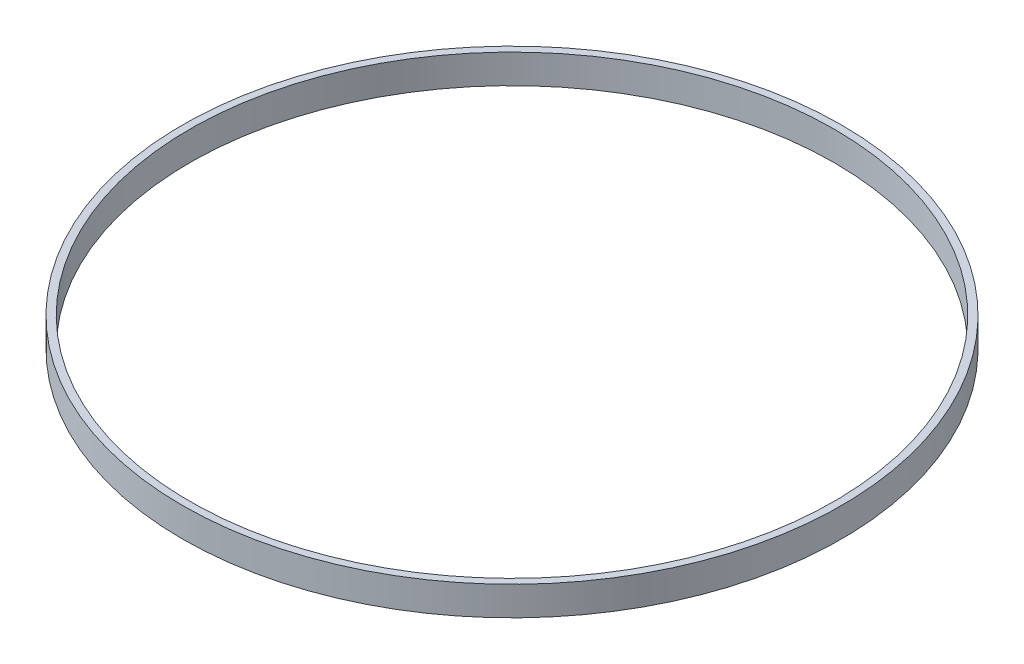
ISO-10303-21;
HEADER;
FILE_DESCRIPTION(('STEP AP214'),'2;1');
FILE_NAME('part.step','',(''),(''),'','','');
FILE_SCHEMA(('AUTOMOTIVE_DESIGN { 1 0 10303 214 1 1 1 1 }'));
ENDSEC;
DATA;
#1=APPLICATION_CONTEXT('core data for automotive mechanical design processes');
#2=APPLICATION_PROTOCOL_DEFINITION('international standard','automotive_design',2000,#1);
#3=PRODUCT_CONTEXT('',#1,'mechanical');
#4=PRODUCT('Part','Part','',(#3));
#5=PRODUCT_RELATED_PRODUCT_CATEGORY('part','',(#4));
#6=PRODUCT_DEFINITION_FORMATION('','',#4);
#7=PRODUCT_DEFINITION_CONTEXT('part definition',#1,'design');
#8=PRODUCT_DEFINITION('design','',#6,#7);
#9=PRODUCT_DEFINITION_SHAPE('','',#8);
#10=(LENGTH_UNIT() NAMED_UNIT(*) SI_UNIT(.MILLI.,.METRE.));
#11=(NAMED_UNIT(*) PLANE_ANGLE_UNIT() SI_UNIT($,.RADIAN.));
#12=(NAMED_UNIT(*) SI_UNIT($,.STERADIAN.) SOLID_ANGLE_UNIT());
#13=UNCERTAINTY_MEASURE_WITH_UNIT(LENGTH_MEASURE(1.E-05),#10,'distance_accuracy_value','');
#14=(GEOMETRIC_REPRESENTATION_CONTEXT(3) GLOBAL_UNCERTAINTY_ASSIGNED_CONTEXT((#13)) GLOBAL_UNIT_ASSIGNED_CONTEXT((#10,
#11,#12)) REPRESENTATION_CONTEXT('',''));
#15=CARTESIAN_POINT('',(0.,0.,0.));
#16=DIRECTION('',(0.,0.,1.));
#17=DIRECTION('',(1.,0.,0.));
#18=AXIS2_PLACEMENT_3D('',#15,#16,#17);
#19=CARTESIAN_POINT('',(0.,0.,0.));
#20=DIRECTION('',(0.,-1.,0.));
#21=DIRECTION('',(0.,0.,-1.));
#22=AXIS2_PLACEMENT_3D('',#19,#20,#21);
#23=CYLINDRICAL_SURFACE('',#22,215.9);
#24=CARTESIAN_POINT('',(0.,0.,0.));
#25=DIRECTION('',(0.,-1.,0.));
#26=DIRECTION('',(0.,0.,-1.));
#27=AXIS2_PLACEMENT_3D('',#24,#25,#26);
#28=CIRCLE('',#27,215.9);
#29=CARTESIAN_POINT('',(0.,0.,-215.9));
#30=VERTEX_POINT('',#29);
#31=EDGE_CURVE('E58',#30,#30,#28,.T.);
#32=ORIENTED_EDGE('',*,*,#31,.F.);
#33=EDGE_LOOP('',(#32));
#34=FACE_BOUND('',#33,.T.);
#35=CARTESIAN_POINT('',(0.,19.05,0.));
#36=DIRECTION('',(0.,-1.,0.));
#37=DIRECTION('',(0.,0.,-1.));
#38=AXIS2_PLACEMENT_3D('',#35,#36,#37);
#39=CIRCLE('',#38,215.9);
#40=CARTESIAN_POINT('',(0.,19.05,-215.9));
#41=VERTEX_POINT('',#40);
#42=EDGE_CURVE('E10',#41,#41,#39,.T.);
#43=ORIENTED_EDGE('',*,*,#42,.T.);
#44=EDGE_LOOP('',(#43));
#45=FACE_BOUND('',#44,.T.);
#46=ADVANCED_FACE('F40',(#34,#45),#23,.T.);
#47=CARTESIAN_POINT('',(-215.9,19.05,0.));
#48=DIRECTION('',(0.,-1.,0.));
#49=DIRECTION('',(0.,0.,-1.));
#50=AXIS2_PLACEMENT_3D('',#47,#48,#49);
#51=PLANE('',#50);
#52=ORIENTED_EDGE('',*,*,#42,.F.);
#53=EDGE_LOOP('',(#52));
#54=FACE_BOUND('',#53,.T.);
#55=CARTESIAN_POINT('',(0.,19.05,0.));
#56=DIRECTION('',(0.,-1.,0.));
#57=DIRECTION('',(0.,0.,-1.));
#58=AXIS2_PLACEMENT_3D('',#55,#56,#57);
#59=CIRCLE('',#58,211.1375);
#60=CARTESIAN_POINT('',(0.,19.05,-211.1375));
#61=VERTEX_POINT('',#60);
#62=EDGE_CURVE('E47',#61,#61,#59,.T.);
#63=ORIENTED_EDGE('',*,*,#62,.T.);
#64=EDGE_LOOP('',(#63));
#65=FACE_BOUND('',#64,.T.);
#66=ADVANCED_FACE('F67',(#54,#65),#51,.F.);
#67=CARTESIAN_POINT('',(0.,0.,0.));
#68=DIRECTION('',(0.,-1.,0.));
#69=DIRECTION('',(0.,0.,-1.));
#70=AXIS2_PLACEMENT_3D('',#67,#68,#69);
#71=CYLINDRICAL_SURFACE('',#70,211.1375);
#72=ORIENTED_EDGE('',*,*,#62,.F.);
#73=EDGE_LOOP('',(#72));
#74=FACE_BOUND('',#73,.T.);
#75=CARTESIAN_POINT('',(0.,0.,0.));
#76=DIRECTION('',(0.,-1.,0.));
#77=DIRECTION('',(0.,0.,-1.));
#78=AXIS2_PLACEMENT_3D('',#75,#76,#77);
#79=CIRCLE('',#78,211.1375);
#80=CARTESIAN_POINT('',(0.,0.,-211.1375));
#81=VERTEX_POINT('',#80);
#82=EDGE_CURVE('E53',#81,#81,#79,.T.);
#83=ORIENTED_EDGE('',*,*,#82,.T.);
#84=EDGE_LOOP('',(#83));
#85=FACE_BOUND('',#84,.T.);
#86=ADVANCED_FACE('F71',(#74,#85),#71,.F.);
#87=CARTESIAN_POINT('',(-215.9,0.,0.));
#88=DIRECTION('',(0.,1.,0.));
#89=DIRECTION('',(0.,0.,1.));
#90=AXIS2_PLACEMENT_3D('',#87,#88,#89);
#91=PLANE('',#90);
#92=ORIENTED_EDGE('',*,*,#82,.F.);
#93=EDGE_LOOP('',(#92));
#94=FACE_BOUND('',#93,.T.);
#95=ORIENTED_EDGE('',*,*,#31,.T.);
#96=EDGE_LOOP('',(#95));
#97=FACE_BOUND('',#96,.T.);
#98=ADVANCED_FACE('F64',(#94,#97),#91,.F.);
#99=CLOSED_SHELL('',(#46,#66,#86,#98));
#100=MANIFOLD_SOLID_BREP('B2',#99);
#101=ADVANCED_BREP_SHAPE_REPRESENTATION('',(#18,#100),#14);
#102=SHAPE_DEFINITION_REPRESENTATION(#9,#101);
ENDSEC;
END-ISO-10303-21;
